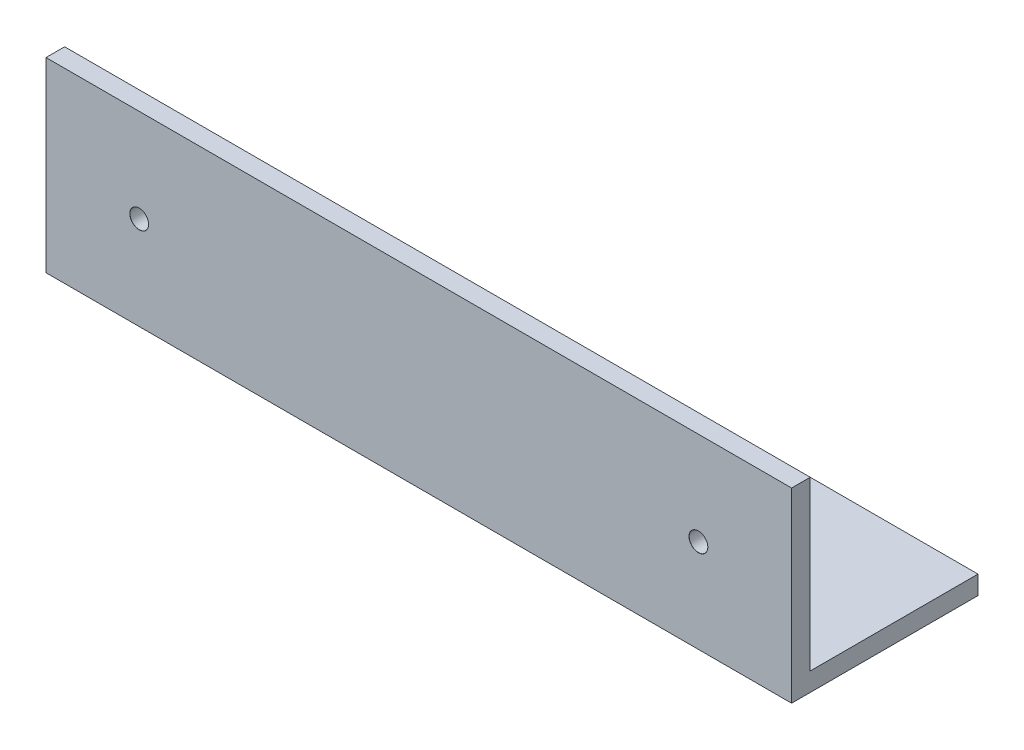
from build123d import *

# Parameters (mm, degrees)
EXTRUDE_THIN1_DEPTH            = 100
F_5_0MM_DOWEL_HOLE1_AT_2_COUNT = 2
F_5_0MM_DOWEL_HOLE1_AT_2_PITCH = 150
F_5_0MM_DOWEL_HOLE2_AT_2_COUNT = 2
F_5_0MM_DOWEL_HOLE2_AT_2_PITCH = 150


with BuildPart() as part:
    # Sketch2 → Extrude-Thin1 (new, symmetric)
    with BuildSketch(Plane(origin=(0, 0, 0), x_dir=(0, 0, -1), z_dir=(1, 0, 0))):
        Polygon((0, 50), (0, 0), (50, 0), (50, 5), (5, 5), (5, 50), align=None)
    extrude(amount=EXTRUDE_THIN1_DEPTH, both=True)

    # Sketch5 → 5.0mm Dowel Hole1 (revolve, cut)
    with BuildSketch(Plane(origin=(75, 25, -5), x_dir=(0, 1, 0), z_dir=(1, 0, 0))):
        Polygon((0, 0), (0, 5), (2.525, 5), (2.5, 4.975), (2.5, 0), align=None)
    f_5_0mm_dowel_hole1 = revolve(axis=Axis((75, 25, -11.35), (0, 0, 1)), mode=Mode.SUBTRACT)

    # 5.0mm Dowel Hole1 at 2: 5.0mm Dowel Hole1 ×2
    with Locations(*[(-i * F_5_0MM_DOWEL_HOLE1_AT_2_PITCH, 0, 0) for i in range(1, F_5_0MM_DOWEL_HOLE1_AT_2_COUNT)]):
        add(f_5_0mm_dowel_hole1, mode=Mode.SUBTRACT)

    # Sketch7 → 5.0mm Dowel Hole2 (revolve, cut)
    with BuildSketch(Plane(origin=(-75, 5, -25), x_dir=(0, 0, 1), z_dir=(1, 0, 0))):
        Polygon((0, 0), (0, 5), (2.525, 5), (2.5, 4.975), (2.5, 0), align=None)
    f_5_0mm_dowel_hole2 = revolve(axis=Axis((-75, 11.35, -25), (0, -1, 0)), mode=Mode.SUBTRACT)

    # 5.0mm Dowel Hole2 at 2: 5.0mm Dowel Hole2 ×2
    with Locations(*[(i * F_5_0MM_DOWEL_HOLE2_AT_2_PITCH, 0, 0) for i in range(1, F_5_0MM_DOWEL_HOLE2_AT_2_COUNT)]):
        add(f_5_0mm_dowel_hole2, mode=Mode.SUBTRACT)


solid = part.part
